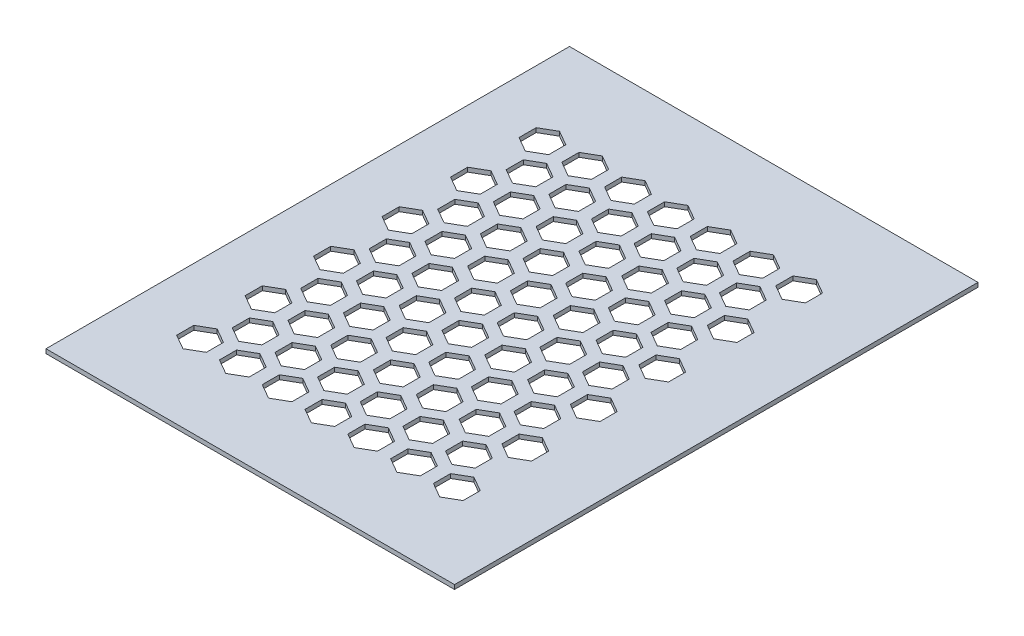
from build123d import *

# Parameters (mm, degrees)
SKETCH1_W           = 303.075
SKETCH1_H           = 388.373399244
BOSS_EXTRUDE1_DEPTH = 3.175
CUT_EXTRUDE1_DEPTH  = 3.175


with BuildPart() as part:
    # Sketch1 → Boss-Extrude1 (new body)
    with BuildSketch(Plane(origin=(0, 402.212122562, 0), x_dir=(1, 0, 0), z_dir=(0, 1, 0))):
        with Locations((-760.665370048, -896.802451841)):
            Rectangle(SKETCH1_W, SKETCH1_H)
    extrude(amount=BOSS_EXTRUDE1_DEPTH)

    # Sketch2 → Cut-Extrude1 (cut)
    with BuildSketch(Plane(origin=(0, 405.387122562, 0), x_dir=(1, 0, 0), z_dir=(0, 1, 0))):
        Polygon((-861.415570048, -1014.789151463), (-872.414092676, -1021.139151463), (-872.414092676, -1033.839151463), (-861.415570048, -1040.189151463), (-850.41704742, -1033.839151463), (-850.41704742, -1021.139151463), align=None)
        Polygon((-829.665570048, -1014.789151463), (-840.664092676, -1021.139151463), (-840.664092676, -1033.839151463), (-829.665570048, -1040.189151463), (-818.66704742, -1033.839151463), (-818.66704742, -1021.139151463), align=None)
        Polygon((-797.915570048, -1014.789151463), (-808.914092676, -1021.139151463), (-808.914092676, -1033.839151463), (-797.915570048, -1040.189151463), (-786.91704742, -1033.839151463), (-786.91704742, -1021.139151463), align=None)
        Polygon((-766.165570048, -1014.789151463), (-777.164092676, -1021.139151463), (-777.164092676, -1033.839151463), (-766.165570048, -1040.189151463), (-755.16704742, -1033.839151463), (-755.16704742, -1021.139151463), align=None)
        Polygon((-734.415570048, -1014.789151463), (-745.414092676, -1021.139151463), (-745.414092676, -1033.839151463), (-734.415570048, -1040.189151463), (-723.41704742, -1033.839151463), (-723.41704742, -1021.139151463), align=None)
        Polygon((-702.665570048, -1014.789151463), (-713.664092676, -1021.139151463), (-713.664092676, -1033.839151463), (-702.665570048, -1040.189151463), (-691.66704742, -1033.839151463), (-691.66704742, -1021.139151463), align=None)
        Polygon((-670.915570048, -1014.789151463), (-681.914092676, -1021.139151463), (-681.914092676, -1033.839151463), (-670.915570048, -1040.189151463), (-659.91704742, -1033.839151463), (-659.91704742, -1021.139151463), align=None)
        Polygon((-834.54204742, -1008.439151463), (-834.54204742, -995.739151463), (-845.540570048, -989.389151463), (-856.539092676, -995.739151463), (-856.539092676, -1008.439151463), (-845.540570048, -1014.789151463), align=None)
        Polygon((-802.89364742, -1008.439151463), (-802.89364742, -995.739151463), (-813.892170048, -989.389151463), (-824.890692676, -995.739151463), (-824.890692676, -1008.439151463), (-813.892170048, -1014.789151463), align=None)
        Polygon((-771.24524742, -1008.439151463), (-771.24524742, -995.739151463), (-782.243770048, -989.389151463), (-793.242292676, -995.739151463), (-793.242292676, -1008.439151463), (-782.243770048, -1014.789151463), align=None)
        Polygon((-739.59684742, -1008.439151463), (-739.59684742, -995.739151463), (-750.595370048, -989.389151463), (-761.593892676, -995.739151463), (-761.593892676, -1008.439151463), (-750.595370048, -1014.789151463), align=None)
        Polygon((-707.94844742, -1008.439151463), (-707.94844742, -995.739151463), (-718.946970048, -989.389151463), (-729.945492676, -995.739151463), (-729.945492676, -1008.439151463), (-718.946970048, -1014.789151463), align=None)
        Polygon((-676.30004742, -1008.439151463), (-676.30004742, -995.739151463), (-687.298570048, -989.389151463), (-698.297092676, -995.739151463), (-698.297092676, -1008.439151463), (-687.298570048, -1014.789151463), align=None)
        Polygon((-670.915570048, -963.989151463), (-681.914092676, -970.339151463), (-681.914092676, -983.039151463), (-670.915570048, -989.389151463), (-659.91704742, -983.039151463), (-659.91704742, -970.339151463), align=None)
        Polygon((-702.665570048, -963.989151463), (-713.664092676, -970.339151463), (-713.664092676, -983.039151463), (-702.665570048, -989.389151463), (-691.66704742, -983.039151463), (-691.66704742, -970.339151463), align=None)
        Polygon((-734.415570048, -963.989151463), (-745.414092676, -970.339151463), (-745.414092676, -983.039151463), (-734.415570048, -989.389151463), (-723.41704742, -983.039151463), (-723.41704742, -970.339151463), align=None)
        Polygon((-766.165570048, -963.989151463), (-777.164092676, -970.339151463), (-777.164092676, -983.039151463), (-766.165570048, -989.389151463), (-755.16704742, -983.039151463), (-755.16704742, -970.339151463), align=None)
        Polygon((-797.915570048, -963.989151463), (-808.914092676, -970.339151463), (-808.914092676, -983.039151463), (-797.915570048, -989.389151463), (-786.91704742, -983.039151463), (-786.91704742, -970.339151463), align=None)
        Polygon((-829.665570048, -963.989151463), (-840.664092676, -970.339151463), (-840.664092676, -983.039151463), (-829.665570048, -989.389151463), (-818.66704742, -983.039151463), (-818.66704742, -970.339151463), align=None)
        Polygon((-861.415570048, -963.989151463), (-872.414092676, -970.339151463), (-872.414092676, -983.039151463), (-861.415570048, -989.389151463), (-850.41704742, -983.039151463), (-850.41704742, -970.339151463), align=None)
        Polygon((-834.54204742, -957.639151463), (-834.54204742, -944.939151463), (-845.540570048, -938.589151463), (-856.539092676, -944.939151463), (-856.539092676, -957.639151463), (-845.540570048, -963.989151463), align=None)
        Polygon((-802.89364742, -957.639151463), (-802.89364742, -944.939151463), (-813.892170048, -938.589151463), (-824.890692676, -944.939151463), (-824.890692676, -957.639151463), (-813.892170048, -963.989151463), align=None)
        Polygon((-771.24524742, -957.639151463), (-771.24524742, -944.939151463), (-782.243770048, -938.589151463), (-793.242292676, -944.939151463), (-793.242292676, -957.639151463), (-782.243770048, -963.989151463), align=None)
        Polygon((-739.59684742, -957.639151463), (-739.59684742, -944.939151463), (-750.595370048, -938.589151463), (-761.593892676, -944.939151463), (-761.593892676, -957.639151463), (-750.595370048, -963.989151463), align=None)
        Polygon((-707.94844742, -957.639151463), (-707.94844742, -944.939151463), (-718.946970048, -938.589151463), (-729.945492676, -944.939151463), (-729.945492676, -957.639151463), (-718.946970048, -963.989151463), align=None)
        Polygon((-676.30004742, -957.639151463), (-676.30004742, -944.939151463), (-687.298570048, -938.589151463), (-698.297092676, -944.939151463), (-698.297092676, -957.639151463), (-687.298570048, -963.989151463), align=None)
        Polygon((-670.915570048, -913.189151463), (-681.914092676, -919.539151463), (-681.914092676, -932.239151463), (-670.915570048, -938.589151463), (-659.91704742, -932.239151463), (-659.91704742, -919.539151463), align=None)
        Polygon((-702.665570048, -913.189151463), (-713.664092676, -919.539151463), (-713.664092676, -932.239151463), (-702.665570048, -938.589151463), (-691.66704742, -932.239151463), (-691.66704742, -919.539151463), align=None)
        Polygon((-734.415570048, -913.189151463), (-745.414092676, -919.539151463), (-745.414092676, -932.239151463), (-734.415570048, -938.589151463), (-723.41704742, -932.239151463), (-723.41704742, -919.539151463), align=None)
        Polygon((-766.165570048, -913.189151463), (-777.164092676, -919.539151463), (-777.164092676, -932.239151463), (-766.165570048, -938.589151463), (-755.16704742, -932.239151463), (-755.16704742, -919.539151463), align=None)
        Polygon((-797.915570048, -913.189151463), (-808.914092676, -919.539151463), (-808.914092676, -932.239151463), (-797.915570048, -938.589151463), (-786.91704742, -932.239151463), (-786.91704742, -919.539151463), align=None)
        Polygon((-829.665570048, -913.189151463), (-840.664092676, -919.539151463), (-840.664092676, -932.239151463), (-829.665570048, -938.589151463), (-818.66704742, -932.239151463), (-818.66704742, -919.539151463), align=None)
        Polygon((-861.415570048, -913.189151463), (-872.414092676, -919.539151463), (-872.414092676, -932.239151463), (-861.415570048, -938.589151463), (-850.41704742, -932.239151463), (-850.41704742, -919.539151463), align=None)
        Polygon((-834.54204742, -906.839151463), (-834.54204742, -894.139151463), (-845.540570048, -887.789151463), (-856.539092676, -894.139151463), (-856.539092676, -906.839151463), (-845.540570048, -913.189151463), align=None)
        Polygon((-802.89364742, -906.839151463), (-802.89364742, -894.139151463), (-813.892170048, -887.789151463), (-824.890692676, -894.139151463), (-824.890692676, -906.839151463), (-813.892170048, -913.189151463), align=None)
        Polygon((-771.24524742, -906.839151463), (-771.24524742, -894.139151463), (-782.243770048, -887.789151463), (-793.242292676, -894.139151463), (-793.242292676, -906.839151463), (-782.243770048, -913.189151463), align=None)
        Polygon((-739.59684742, -906.839151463), (-739.59684742, -894.139151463), (-750.595370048, -887.789151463), (-761.593892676, -894.139151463), (-761.593892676, -906.839151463), (-750.595370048, -913.189151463), align=None)
        Polygon((-707.94844742, -906.839151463), (-707.94844742, -894.139151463), (-718.946970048, -887.789151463), (-729.945492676, -894.139151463), (-729.945492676, -906.839151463), (-718.946970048, -913.189151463), align=None)
        Polygon((-676.30004742, -906.839151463), (-676.30004742, -894.139151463), (-687.298570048, -887.789151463), (-698.297092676, -894.139151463), (-698.297092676, -906.839151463), (-687.298570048, -913.189151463), align=None)
        Polygon((-670.915570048, -862.389151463), (-681.914092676, -868.739151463), (-681.914092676, -881.439151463), (-670.915570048, -887.789151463), (-659.91704742, -881.439151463), (-659.91704742, -868.739151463), align=None)
        Polygon((-702.665570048, -862.389151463), (-713.664092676, -868.739151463), (-713.664092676, -881.439151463), (-702.665570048, -887.789151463), (-691.66704742, -881.439151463), (-691.66704742, -868.739151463), align=None)
        Polygon((-734.415570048, -862.389151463), (-745.414092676, -868.739151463), (-745.414092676, -881.439151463), (-734.415570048, -887.789151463), (-723.41704742, -881.439151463), (-723.41704742, -868.739151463), align=None)
        Polygon((-766.165570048, -862.389151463), (-777.164092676, -868.739151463), (-777.164092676, -881.439151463), (-766.165570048, -887.789151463), (-755.16704742, -881.439151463), (-755.16704742, -868.739151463), align=None)
        Polygon((-797.915570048, -862.389151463), (-808.914092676, -868.739151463), (-808.914092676, -881.439151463), (-797.915570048, -887.789151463), (-786.91704742, -881.439151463), (-786.91704742, -868.739151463), align=None)
        Polygon((-829.665570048, -862.389151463), (-840.664092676, -868.739151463), (-840.664092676, -881.439151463), (-829.665570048, -887.789151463), (-818.66704742, -881.439151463), (-818.66704742, -868.739151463), align=None)
        Polygon((-861.415570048, -862.389151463), (-872.414092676, -868.739151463), (-872.414092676, -881.439151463), (-861.415570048, -887.789151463), (-850.41704742, -881.439151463), (-850.41704742, -868.739151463), align=None)
        Polygon((-834.54204742, -856.039151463), (-834.54204742, -843.339151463), (-845.540570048, -836.989151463), (-856.539092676, -843.339151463), (-856.539092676, -856.039151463), (-845.540570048, -862.389151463), align=None)
        Polygon((-802.89364742, -856.039151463), (-802.89364742, -843.339151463), (-813.892170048, -836.989151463), (-824.890692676, -843.339151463), (-824.890692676, -856.039151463), (-813.892170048, -862.389151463), align=None)
        Polygon((-771.24524742, -856.039151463), (-771.24524742, -843.339151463), (-782.243770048, -836.989151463), (-793.242292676, -843.339151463), (-793.242292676, -856.039151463), (-782.243770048, -862.389151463), align=None)
        Polygon((-739.59684742, -856.039151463), (-739.59684742, -843.339151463), (-750.595370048, -836.989151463), (-761.593892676, -843.339151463), (-761.593892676, -856.039151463), (-750.595370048, -862.389151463), align=None)
        Polygon((-707.94844742, -856.039151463), (-707.94844742, -843.339151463), (-718.946970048, -836.989151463), (-729.945492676, -843.339151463), (-729.945492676, -856.039151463), (-718.946970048, -862.389151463), align=None)
        Polygon((-676.30004742, -856.039151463), (-676.30004742, -843.339151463), (-687.298570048, -836.989151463), (-698.297092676, -843.339151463), (-698.297092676, -856.039151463), (-687.298570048, -862.389151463), align=None)
        Polygon((-670.915570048, -811.589151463), (-681.914092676, -817.939151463), (-681.914092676, -830.639151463), (-670.915570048, -836.989151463), (-659.91704742, -830.639151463), (-659.91704742, -817.939151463), align=None)
        Polygon((-702.665570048, -811.589151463), (-713.664092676, -817.939151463), (-713.664092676, -830.639151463), (-702.665570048, -836.989151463), (-691.66704742, -830.639151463), (-691.66704742, -817.939151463), align=None)
        Polygon((-734.415570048, -811.589151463), (-745.414092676, -817.939151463), (-745.414092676, -830.639151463), (-734.415570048, -836.989151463), (-723.41704742, -830.639151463), (-723.41704742, -817.939151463), align=None)
        Polygon((-766.165570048, -811.589151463), (-777.164092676, -817.939151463), (-777.164092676, -830.639151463), (-766.165570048, -836.989151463), (-755.16704742, -830.639151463), (-755.16704742, -817.939151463), align=None)
        Polygon((-797.915570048, -811.589151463), (-808.914092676, -817.939151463), (-808.914092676, -830.639151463), (-797.915570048, -836.989151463), (-786.91704742, -830.639151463), (-786.91704742, -817.939151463), align=None)
        Polygon((-829.665570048, -811.589151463), (-840.664092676, -817.939151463), (-840.664092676, -830.639151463), (-829.665570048, -836.989151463), (-818.66704742, -830.639151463), (-818.66704742, -817.939151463), align=None)
        Polygon((-861.415570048, -811.589151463), (-872.414092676, -817.939151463), (-872.414092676, -830.639151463), (-861.415570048, -836.989151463), (-850.41704742, -830.639151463), (-850.41704742, -817.939151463), align=None)
        Polygon((-834.54204742, -805.239151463), (-834.54204742, -792.539151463), (-845.540570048, -786.189151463), (-856.539092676, -792.539151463), (-856.539092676, -805.239151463), (-845.540570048, -811.589151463), align=None)
        Polygon((-802.89364742, -805.239151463), (-802.89364742, -792.539151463), (-813.892170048, -786.189151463), (-824.890692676, -792.539151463), (-824.890692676, -805.239151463), (-813.892170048, -811.589151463), align=None)
        Polygon((-771.24524742, -805.239151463), (-771.24524742, -792.539151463), (-782.243770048, -786.189151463), (-793.242292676, -792.539151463), (-793.242292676, -805.239151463), (-782.243770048, -811.589151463), align=None)
        Polygon((-739.59684742, -805.239151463), (-739.59684742, -792.539151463), (-750.595370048, -786.189151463), (-761.593892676, -792.539151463), (-761.593892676, -805.239151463), (-750.595370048, -811.589151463), align=None)
        Polygon((-707.94844742, -805.239151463), (-707.94844742, -792.539151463), (-718.946970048, -786.189151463), (-729.945492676, -792.539151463), (-729.945492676, -805.239151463), (-718.946970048, -811.589151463), align=None)
        Polygon((-676.30004742, -805.239151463), (-676.30004742, -792.539151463), (-687.298570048, -786.189151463), (-698.297092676, -792.539151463), (-698.297092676, -805.239151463), (-687.298570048, -811.589151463), align=None)
        Polygon((-872.414092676, -767.139151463), (-872.414092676, -779.839151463), (-861.415570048, -786.189151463), (-850.41704742, -779.839151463), (-850.41704742, -767.139151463), (-861.415570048, -760.789151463), align=None)
        Polygon((-840.664092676, -767.139151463), (-840.664092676, -779.839151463), (-829.665570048, -786.189151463), (-818.66704742, -779.839151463), (-818.66704742, -767.139151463), (-829.665570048, -760.789151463), align=None)
        Polygon((-808.914092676, -767.139151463), (-808.914092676, -779.839151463), (-797.915570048, -786.189151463), (-786.91704742, -779.839151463), (-786.91704742, -767.139151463), (-797.915570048, -760.789151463), align=None)
        Polygon((-777.164092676, -767.139151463), (-777.164092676, -779.839151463), (-766.165570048, -786.189151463), (-755.16704742, -779.839151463), (-755.16704742, -767.139151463), (-766.165570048, -760.789151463), align=None)
        Polygon((-745.414092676, -767.139151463), (-745.414092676, -779.839151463), (-734.415570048, -786.189151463), (-723.41704742, -779.839151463), (-723.41704742, -767.139151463), (-734.415570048, -760.789151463), align=None)
        Polygon((-713.664092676, -767.139151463), (-713.664092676, -779.839151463), (-702.665570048, -786.189151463), (-691.66704742, -779.839151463), (-691.66704742, -767.139151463), (-702.665570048, -760.789151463), align=None)
        Polygon((-681.914092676, -767.139151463), (-681.914092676, -779.839151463), (-670.915570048, -786.189151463), (-659.91704742, -779.839151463), (-659.91704742, -767.139151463), (-670.915570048, -760.789151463), align=None)
    extrude(amount=-CUT_EXTRUDE1_DEPTH, mode=Mode.SUBTRACT)


solid = part.part
